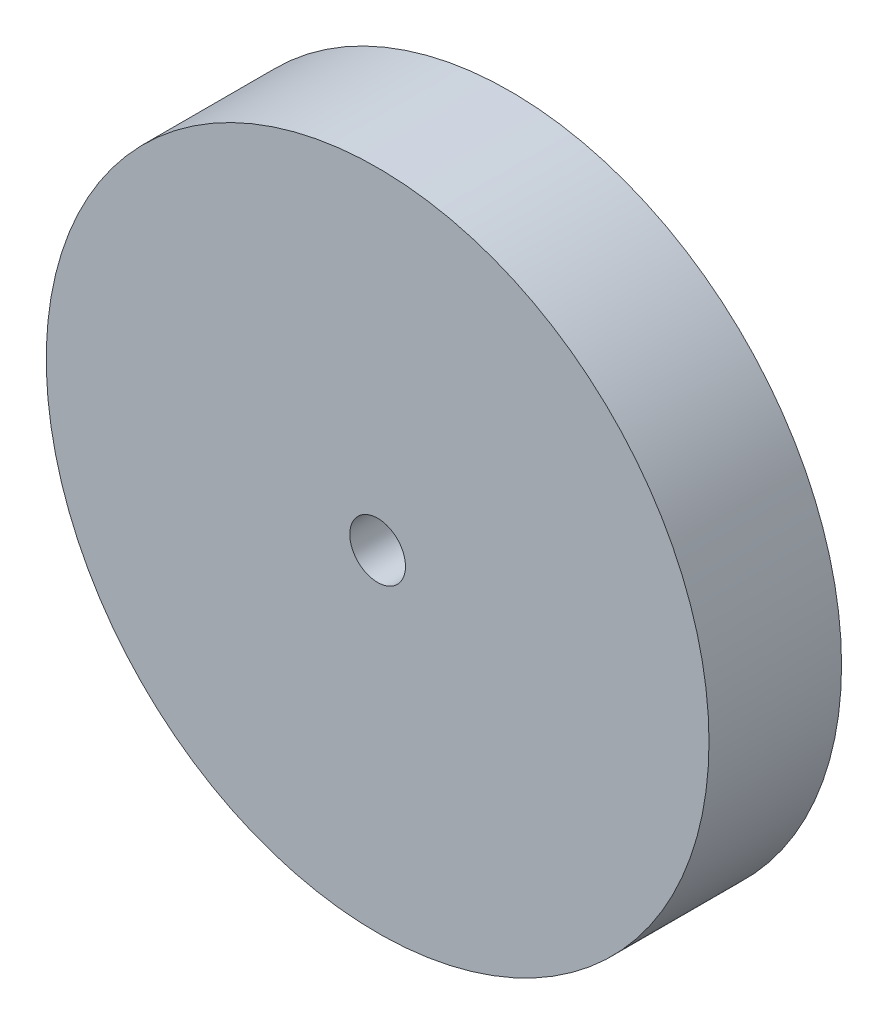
from build123d import *

# Parameters (mm, degrees)
ESQUISSE1_R        = 25
BOSS_EXTRU_1_DEPTH = 10
TROU_TARAUD_M51_D  = 4.2


with BuildPart() as part:
    # Esquisse1 → Boss.-Extru.1 (new body)
    with BuildSketch(Plane.XY):
        Circle(ESQUISSE1_R)
    extrude(amount=BOSS_EXTRU_1_DEPTH)

    # Trou taraud_ M51 (through all)
    with Locations(Plane.XY.offset(10)):
        with Locations((0, 0)):
            Hole(TROU_TARAUD_M51_D / 2)


solid = part.part
